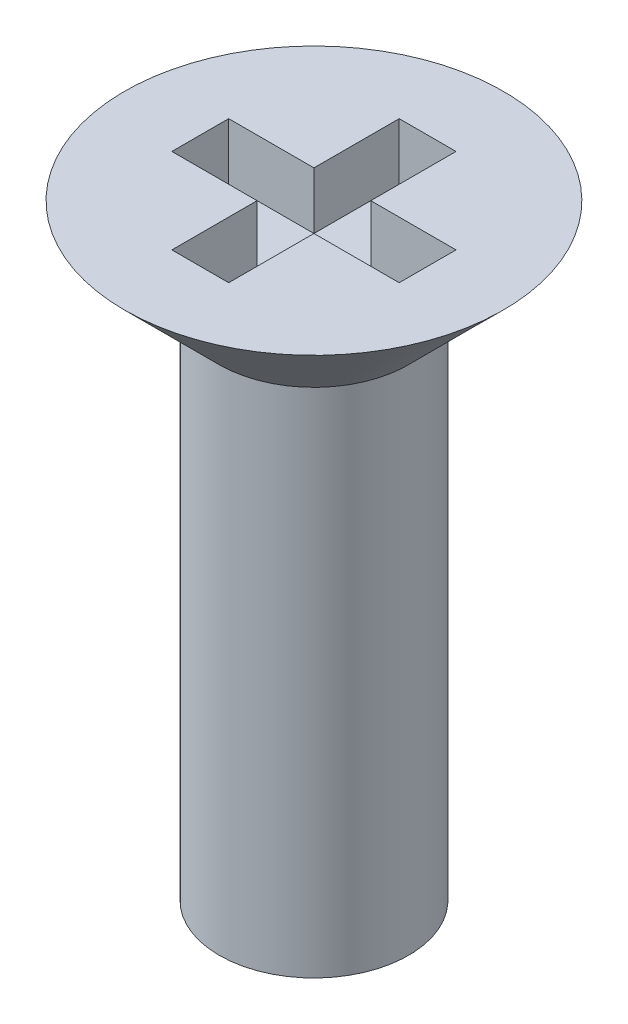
ISO-10303-21;
HEADER;
FILE_DESCRIPTION(('STEP AP214'),'2;1');
FILE_NAME('part.step','',(''),(''),'','','');
FILE_SCHEMA(('AUTOMOTIVE_DESIGN { 1 0 10303 214 1 1 1 1 }'));
ENDSEC;
DATA;
#1=APPLICATION_CONTEXT('core data for automotive mechanical design processes');
#2=APPLICATION_PROTOCOL_DEFINITION('international standard','automotive_design',2000,#1);
#3=PRODUCT_CONTEXT('',#1,'mechanical');
#4=PRODUCT('Part','Part','',(#3));
#5=PRODUCT_RELATED_PRODUCT_CATEGORY('part','',(#4));
#6=PRODUCT_DEFINITION_FORMATION('','',#4);
#7=PRODUCT_DEFINITION_CONTEXT('part definition',#1,'design');
#8=PRODUCT_DEFINITION('design','',#6,#7);
#9=PRODUCT_DEFINITION_SHAPE('','',#8);
#10=(LENGTH_UNIT() NAMED_UNIT(*) SI_UNIT(.MILLI.,.METRE.));
#11=(NAMED_UNIT(*) PLANE_ANGLE_UNIT() SI_UNIT($,.RADIAN.));
#12=(NAMED_UNIT(*) SI_UNIT($,.STERADIAN.) SOLID_ANGLE_UNIT());
#13=UNCERTAINTY_MEASURE_WITH_UNIT(LENGTH_MEASURE(1.E-05),#10,'distance_accuracy_value','');
#14=(GEOMETRIC_REPRESENTATION_CONTEXT(3) GLOBAL_UNCERTAINTY_ASSIGNED_CONTEXT((#13)) GLOBAL_UNIT_ASSIGNED_CONTEXT((#10,
#11,#12)) REPRESENTATION_CONTEXT('',''));
#15=CARTESIAN_POINT('',(0.,0.,0.));
#16=DIRECTION('',(0.,0.,1.));
#17=DIRECTION('',(1.,0.,0.));
#18=AXIS2_PLACEMENT_3D('',#15,#16,#17);
#19=CARTESIAN_POINT('',(2.5,8.,0.));
#20=DIRECTION('',(0.,-1.,0.));
#21=DIRECTION('',(0.,0.,-1.));
#22=AXIS2_PLACEMENT_3D('',#19,#20,#21);
#23=PLANE('',#22);
#24=CARTESIAN_POINT('',(0.,8.00000000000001,0.));
#25=DIRECTION('',(0.,1.,0.));
#26=DIRECTION('',(0.,0.,1.));
#27=AXIS2_PLACEMENT_3D('',#24,#25,#26);
#28=CIRCLE('',#27,2.5);
#29=CARTESIAN_POINT('',(0.,8.00000000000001,2.5));
#30=VERTEX_POINT('',#29);
#31=EDGE_CURVE('E297',#30,#30,#28,.T.);
#32=ORIENTED_EDGE('',*,*,#31,.T.);
#33=EDGE_LOOP('',(#32));
#34=FACE_BOUND('',#33,.T.);
#35=DIRECTION('',(-1.,0.,1.49574703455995E-09));
#36=VECTOR('',#35,1.);
#37=CARTESIAN_POINT('',(5.60905178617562E-10,8.,0.375));
#38=LINE('',#37,#36);
#39=CARTESIAN_POINT('',(-0.375,8.,0.375000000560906));
#40=VERTEX_POINT('',#39);
#41=CARTESIAN_POINT('',(-1.49999999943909,8.,0.375000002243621));
#42=VERTEX_POINT('',#41);
#43=EDGE_CURVE('E238',#40,#42,#38,.T.);
#44=ORIENTED_EDGE('',*,*,#43,.T.);
#45=DIRECTION('',(1.49574714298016E-09,0.,1.));
#46=VECTOR('',#45,1.);
#47=CARTESIAN_POINT('',(-1.50000000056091,8.,-0.37499999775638));
#48=LINE('',#47,#46);
#49=CARTESIAN_POINT('',(-1.50000000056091,8.,-0.37499999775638));
#50=VERTEX_POINT('',#49);
#51=EDGE_CURVE('E254',#50,#42,#48,.T.);
#52=ORIENTED_EDGE('',*,*,#51,.F.);
#53=DIRECTION('',(1.,0.,-1.49574725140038E-09));
#54=VECTOR('',#53,1.);
#55=CARTESIAN_POINT('',(-1.50000000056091,8.,-0.37499999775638));
#56=LINE('',#55,#54);
#57=CARTESIAN_POINT('',(-0.375000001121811,8.,-0.375));
#58=VERTEX_POINT('',#57);
#59=EDGE_CURVE('E258',#50,#58,#56,.T.);
#60=ORIENTED_EDGE('',*,*,#59,.T.);
#61=DIRECTION('',(-2.99149417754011E-09,0.,-1.));
#62=VECTOR('',#61,1.);
#63=CARTESIAN_POINT('',(-0.375,8.,1.12181035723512E-09));
#64=LINE('',#63,#62);
#65=CARTESIAN_POINT('',(-0.375000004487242,8.,-1.49999999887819));
#66=VERTEX_POINT('',#65);
#67=EDGE_CURVE('E207',#58,#66,#64,.T.);
#68=ORIENTED_EDGE('',*,*,#67,.T.);
#69=DIRECTION('',(-1.,0.,2.99149428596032E-09));
#70=VECTOR('',#69,1.);
#71=CARTESIAN_POINT('',(0.374999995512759,8.,-1.50000000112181));
#72=LINE('',#71,#70);
#73=CARTESIAN_POINT('',(0.374999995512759,8.,-1.50000000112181));
#74=VERTEX_POINT('',#73);
#75=EDGE_CURVE('E223',#74,#66,#72,.T.);
#76=ORIENTED_EDGE('',*,*,#75,.F.);
#77=DIRECTION('',(2.99149439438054E-09,0.,1.));
#78=VECTOR('',#77,1.);
#79=CARTESIAN_POINT('',(0.374999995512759,8.,-1.50000000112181));
#80=LINE('',#79,#78);
#81=CARTESIAN_POINT('',(0.375,8.,-0.375000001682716));
#82=VERTEX_POINT('',#81);
#83=EDGE_CURVE('E212',#74,#82,#80,.T.);
#84=ORIENTED_EDGE('',*,*,#83,.T.);
#85=DIRECTION('',(1.,0.,-4.48724087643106E-09));
#86=VECTOR('',#85,1.);
#87=CARTESIAN_POINT('',(-1.68271536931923E-09,8.,-0.375));
#88=LINE('',#87,#86);
#89=CARTESIAN_POINT('',(1.49999999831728,8.,-0.375000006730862));
#90=VERTEX_POINT('',#89);
#91=EDGE_CURVE('E200',#82,#90,#88,.T.);
#92=ORIENTED_EDGE('',*,*,#91,.T.);
#93=DIRECTION('',(-4.48724098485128E-09,0.,-1.));
#94=VECTOR('',#93,1.);
#95=CARTESIAN_POINT('',(1.50000000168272,8.,0.374999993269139));
#96=LINE('',#95,#94);
#97=CARTESIAN_POINT('',(1.50000000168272,8.,0.374999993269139));
#98=VERTEX_POINT('',#97);
#99=EDGE_CURVE('E179',#98,#90,#96,.T.);
#100=ORIENTED_EDGE('',*,*,#99,.F.);
#101=CARTESIAN_POINT('',(0.375,8.,0.374999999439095));
#102=VERTEX_POINT('',#101);
#103=EDGE_CURVE('E251',#98,#102,#38,.T.);
#104=ORIENTED_EDGE('',*,*,#103,.T.);
#105=DIRECTION('',(0.,0.,1.));
#106=VECTOR('',#105,1.);
#107=CARTESIAN_POINT('',(0.375,8.,0.));
#108=LINE('',#107,#106);
#109=CARTESIAN_POINT('',(0.375,8.,1.5));
#110=VERTEX_POINT('',#109);
#111=EDGE_CURVE('E81',#102,#110,#108,.T.);
#112=ORIENTED_EDGE('',*,*,#111,.T.);
#113=DIRECTION('',(1.,0.,0.));
#114=VECTOR('',#113,1.);
#115=CARTESIAN_POINT('',(-0.375,8.,1.5));
#116=LINE('',#115,#114);
#117=CARTESIAN_POINT('',(-0.375,8.,1.5));
#118=VERTEX_POINT('',#117);
#119=EDGE_CURVE('E285',#118,#110,#116,.T.);
#120=ORIENTED_EDGE('',*,*,#119,.F.);
#121=DIRECTION('',(0.,0.,-1.));
#122=VECTOR('',#121,1.);
#123=CARTESIAN_POINT('',(-0.375,8.,1.5));
#124=LINE('',#123,#122);
#125=EDGE_CURVE('E276',#118,#40,#124,.T.);
#126=ORIENTED_EDGE('',*,*,#125,.T.);
#127=EDGE_LOOP('',(#44,#52,#60,#68,#76,#84,#92,#100,#104,#112,#120,#126));
#128=FACE_BOUND('',#127,.T.);
#129=ADVANCED_FACE('F46',(#34,#128),#23,.F.);
#130=CARTESIAN_POINT('',(0.375,7.25,0.));
#131=DIRECTION('',(-1.,0.,0.));
#132=DIRECTION('',(0.,0.,1.));
#133=AXIS2_PLACEMENT_3D('',#130,#131,#132);
#134=PLANE('',#133);
#135=ORIENTED_EDGE('',*,*,#111,.F.);
#136=DIRECTION('',(0.,-1.,0.));
#137=VECTOR('',#136,1.);
#138=CARTESIAN_POINT('',(0.375,7.25,0.374999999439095));
#139=LINE('',#138,#137);
#140=CARTESIAN_POINT('',(0.375,7.25,0.374999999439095));
#141=VERTEX_POINT('',#140);
#142=EDGE_CURVE('E269',#102,#141,#139,.T.);
#143=ORIENTED_EDGE('',*,*,#142,.T.);
#144=DIRECTION('',(0.,0.,1.));
#145=VECTOR('',#144,1.);
#146=CARTESIAN_POINT('',(0.375,7.25,0.));
#147=LINE('',#146,#145);
#148=CARTESIAN_POINT('',(0.375,7.25,1.5));
#149=VERTEX_POINT('',#148);
#150=EDGE_CURVE('E273',#141,#149,#147,.T.);
#151=ORIENTED_EDGE('',*,*,#150,.T.);
#152=DIRECTION('',(0.,1.,0.));
#153=VECTOR('',#152,1.);
#154=CARTESIAN_POINT('',(0.375,7.25,1.5));
#155=LINE('',#154,#153);
#156=EDGE_CURVE('E294',#149,#110,#155,.T.);
#157=ORIENTED_EDGE('',*,*,#156,.T.);
#158=EDGE_LOOP('',(#135,#143,#151,#157));
#159=FACE_BOUND('',#158,.T.);
#160=ADVANCED_FACE('F316',(#159),#134,.T.);
#161=CARTESIAN_POINT('',(-0.375,7.25,1.5));
#162=DIRECTION('',(1.,0.,0.));
#163=DIRECTION('',(0.,0.,-1.));
#164=AXIS2_PLACEMENT_3D('',#161,#162,#163);
#165=PLANE('',#164);
#166=DIRECTION('',(0.,0.,-1.));
#167=VECTOR('',#166,1.);
#168=CARTESIAN_POINT('',(-0.375,7.25,1.5));
#169=LINE('',#168,#167);
#170=CARTESIAN_POINT('',(-0.375,7.25,1.5));
#171=VERTEX_POINT('',#170);
#172=CARTESIAN_POINT('',(-0.375,7.25,0.375000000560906));
#173=VERTEX_POINT('',#172);
#174=EDGE_CURVE('E280',#171,#173,#169,.T.);
#175=ORIENTED_EDGE('',*,*,#174,.T.);
#176=DIRECTION('',(0.,1.,0.));
#177=VECTOR('',#176,1.);
#178=CARTESIAN_POINT('',(-0.375,7.25,0.375000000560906));
#179=LINE('',#178,#177);
#180=EDGE_CURVE('E92',#173,#40,#179,.T.);
#181=ORIENTED_EDGE('',*,*,#180,.T.);
#182=ORIENTED_EDGE('',*,*,#125,.F.);
#183=DIRECTION('',(0.,1.,0.));
#184=VECTOR('',#183,1.);
#185=CARTESIAN_POINT('',(-0.375,7.25,1.5));
#186=LINE('',#185,#184);
#187=EDGE_CURVE('E67',#171,#118,#186,.T.);
#188=ORIENTED_EDGE('',*,*,#187,.F.);
#189=EDGE_LOOP('',(#175,#181,#182,#188));
#190=FACE_BOUND('',#189,.T.);
#191=ADVANCED_FACE('F312',(#190),#165,.T.);
#192=CARTESIAN_POINT('',(0.,0.,0.));
#193=DIRECTION('',(0.,1.,0.));
#194=DIRECTION('',(0.,0.,1.));
#195=AXIS2_PLACEMENT_3D('',#192,#193,#194);
#196=PLANE('',#195);
#197=CARTESIAN_POINT('',(0.,0.,0.));
#198=DIRECTION('',(0.,1.,0.));
#199=DIRECTION('',(0.,0.,1.));
#200=AXIS2_PLACEMENT_3D('',#197,#198,#199);
#201=CIRCLE('',#200,1.25000000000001);
#202=CARTESIAN_POINT('',(0.,0.,1.25000000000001));
#203=VERTEX_POINT('',#202);
#204=EDGE_CURVE('E11',#203,#203,#201,.T.);
#205=ORIENTED_EDGE('',*,*,#204,.F.);
#206=EDGE_LOOP('',(#205));
#207=FACE_BOUND('',#206,.T.);
#208=ADVANCED_FACE('F48',(#207),#196,.F.);
#209=CARTESIAN_POINT('',(0.,90.8693037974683,0.));
#210=DIRECTION('',(0.,1.,0.));
#211=DIRECTION('',(0.,0.,1.));
#212=AXIS2_PLACEMENT_3D('',#209,#210,#211);
#213=CYLINDRICAL_SURFACE('',#212,1.25000000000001);
#214=CARTESIAN_POINT('',(0.,6.75000000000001,0.));
#215=DIRECTION('',(0.,1.,0.));
#216=DIRECTION('',(0.,0.,1.));
#217=AXIS2_PLACEMENT_3D('',#214,#215,#216);
#218=CIRCLE('',#217,1.25000000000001);
#219=CARTESIAN_POINT('',(0.,6.75000000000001,1.25000000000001));
#220=VERTEX_POINT('',#219);
#221=EDGE_CURVE('E56',#220,#220,#218,.T.);
#222=ORIENTED_EDGE('',*,*,#221,.F.);
#223=EDGE_LOOP('',(#222));
#224=FACE_BOUND('',#223,.T.);
#225=ORIENTED_EDGE('',*,*,#204,.T.);
#226=EDGE_LOOP('',(#225));
#227=FACE_BOUND('',#226,.T.);
#228=ADVANCED_FACE('F306',(#224,#227),#213,.T.);
#229=CARTESIAN_POINT('',(0.,6.75000000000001,0.));
#230=DIRECTION('',(0.,1.,0.));
#231=DIRECTION('',(0.,0.,1.));
#232=AXIS2_PLACEMENT_3D('',#229,#230,#231);
#233=CONICAL_SURFACE('',#232,1.25000000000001,0.785398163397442);
#234=ORIENTED_EDGE('',*,*,#31,.F.);
#235=EDGE_LOOP('',(#234));
#236=FACE_BOUND('',#235,.T.);
#237=ORIENTED_EDGE('',*,*,#221,.T.);
#238=EDGE_LOOP('',(#237));
#239=FACE_BOUND('',#238,.T.);
#240=ADVANCED_FACE('F304',(#236,#239),#233,.T.);
#241=CARTESIAN_POINT('',(-0.375,7.25,1.5));
#242=DIRECTION('',(0.,0.,1.));
#243=DIRECTION('',(1.,0.,0.));
#244=AXIS2_PLACEMENT_3D('',#241,#242,#243);
#245=PLANE('',#244);
#246=ORIENTED_EDGE('',*,*,#119,.T.);
#247=ORIENTED_EDGE('',*,*,#156,.F.);
#248=DIRECTION('',(1.,0.,0.));
#249=VECTOR('',#248,1.);
#250=CARTESIAN_POINT('',(-0.375,7.25,1.5));
#251=LINE('',#250,#249);
#252=EDGE_CURVE('E275',#171,#149,#251,.T.);
#253=ORIENTED_EDGE('',*,*,#252,.F.);
#254=ORIENTED_EDGE('',*,*,#187,.T.);
#255=EDGE_LOOP('',(#246,#247,#253,#254));
#256=FACE_BOUND('',#255,.T.);
#257=ADVANCED_FACE('F329',(#256),#245,.F.);
#258=CARTESIAN_POINT('',(0.375,7.25,1.5));
#259=DIRECTION('',(0.,1.,0.));
#260=DIRECTION('',(0.,0.,1.));
#261=AXIS2_PLACEMENT_3D('',#258,#259,#260);
#262=PLANE('',#261);
#263=ORIENTED_EDGE('',*,*,#150,.F.);
#264=DIRECTION('',(-1.,0.,1.49574703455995E-09));
#265=VECTOR('',#264,1.);
#266=CARTESIAN_POINT('',(5.60905178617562E-10,7.25,0.375));
#267=LINE('',#266,#265);
#268=CARTESIAN_POINT('',(1.50000000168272,7.25,0.374999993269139));
#269=VERTEX_POINT('',#268);
#270=EDGE_CURVE('E192',#269,#141,#267,.T.);
#271=ORIENTED_EDGE('',*,*,#270,.F.);
#272=DIRECTION('',(-4.48724098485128E-09,0.,-1.));
#273=VECTOR('',#272,1.);
#274=CARTESIAN_POINT('',(1.50000000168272,7.25,0.374999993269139));
#275=LINE('',#274,#273);
#276=CARTESIAN_POINT('',(1.49999999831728,7.25,-0.375000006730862));
#277=VERTEX_POINT('',#276);
#278=EDGE_CURVE('E178',#269,#277,#275,.T.);
#279=ORIENTED_EDGE('',*,*,#278,.T.);
#280=DIRECTION('',(1.,0.,-4.48724087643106E-09));
#281=VECTOR('',#280,1.);
#282=CARTESIAN_POINT('',(-1.68271536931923E-09,7.25,-0.375));
#283=LINE('',#282,#281);
#284=CARTESIAN_POINT('',(0.375,7.25,-0.375000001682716));
#285=VERTEX_POINT('',#284);
#286=EDGE_CURVE('E166',#285,#277,#283,.T.);
#287=ORIENTED_EDGE('',*,*,#286,.F.);
#288=DIRECTION('',(2.99149439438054E-09,0.,1.));
#289=VECTOR('',#288,1.);
#290=CARTESIAN_POINT('',(0.374999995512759,7.25,-1.50000000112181));
#291=LINE('',#290,#289);
#292=CARTESIAN_POINT('',(0.374999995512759,7.25,-1.50000000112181));
#293=VERTEX_POINT('',#292);
#294=EDGE_CURVE('E216',#293,#285,#291,.T.);
#295=ORIENTED_EDGE('',*,*,#294,.F.);
#296=DIRECTION('',(-1.,0.,2.99149428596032E-09));
#297=VECTOR('',#296,1.);
#298=CARTESIAN_POINT('',(0.374999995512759,7.25,-1.50000000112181));
#299=LINE('',#298,#297);
#300=CARTESIAN_POINT('',(-0.375000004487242,7.25,-1.49999999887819));
#301=VERTEX_POINT('',#300);
#302=EDGE_CURVE('E211',#293,#301,#299,.T.);
#303=ORIENTED_EDGE('',*,*,#302,.T.);
#304=DIRECTION('',(-2.99149417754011E-09,0.,-1.));
#305=VECTOR('',#304,1.);
#306=CARTESIAN_POINT('',(-0.375,7.25,1.12181035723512E-09));
#307=LINE('',#306,#305);
#308=CARTESIAN_POINT('',(-0.375000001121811,7.25,-0.375));
#309=VERTEX_POINT('',#308);
#310=EDGE_CURVE('E208',#309,#301,#307,.T.);
#311=ORIENTED_EDGE('',*,*,#310,.F.);
#312=DIRECTION('',(1.,0.,-1.49574725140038E-09));
#313=VECTOR('',#312,1.);
#314=CARTESIAN_POINT('',(-1.50000000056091,7.25,-0.37499999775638));
#315=LINE('',#314,#313);
#316=CARTESIAN_POINT('',(-1.50000000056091,7.25,-0.37499999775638));
#317=VERTEX_POINT('',#316);
#318=EDGE_CURVE('E246',#317,#309,#315,.T.);
#319=ORIENTED_EDGE('',*,*,#318,.F.);
#320=DIRECTION('',(1.49574714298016E-09,0.,1.));
#321=VECTOR('',#320,1.);
#322=CARTESIAN_POINT('',(-1.50000000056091,7.25,-0.37499999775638));
#323=LINE('',#322,#321);
#324=CARTESIAN_POINT('',(-1.49999999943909,7.25,0.375000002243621));
#325=VERTEX_POINT('',#324);
#326=EDGE_CURVE('E241',#317,#325,#323,.T.);
#327=ORIENTED_EDGE('',*,*,#326,.T.);
#328=EDGE_CURVE('E242',#173,#325,#267,.T.);
#329=ORIENTED_EDGE('',*,*,#328,.F.);
#330=ORIENTED_EDGE('',*,*,#174,.F.);
#331=ORIENTED_EDGE('',*,*,#252,.T.);
#332=EDGE_LOOP('',(#263,#271,#279,#287,#295,#303,#311,#319,#327,#329,#330,#331));
#333=FACE_BOUND('',#332,.T.);
#334=ADVANCED_FACE('F191',(#333),#262,.T.);
#335=CARTESIAN_POINT('',(5.60905178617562E-10,7.25,0.375));
#336=DIRECTION('',(-1.49574703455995E-09,0.,-1.));
#337=DIRECTION('',(-1.,0.,1.49574703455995E-09));
#338=AXIS2_PLACEMENT_3D('',#335,#336,#337);
#339=PLANE('',#338);
#340=ORIENTED_EDGE('',*,*,#103,.F.);
#341=DIRECTION('',(0.,1.,0.));
#342=VECTOR('',#341,1.);
#343=CARTESIAN_POINT('',(1.50000000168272,7.25,0.374999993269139));
#344=LINE('',#343,#342);
#345=EDGE_CURVE('E188',#269,#98,#344,.T.);
#346=ORIENTED_EDGE('',*,*,#345,.F.);
#347=ORIENTED_EDGE('',*,*,#270,.T.);
#348=ORIENTED_EDGE('',*,*,#142,.F.);
#349=EDGE_LOOP('',(#340,#346,#347,#348));
#350=FACE_BOUND('',#349,.T.);
#351=ADVANCED_FACE('F339',(#350),#339,.T.);
#352=CARTESIAN_POINT('',(-1.50000000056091,7.25,-0.37499999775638));
#353=DIRECTION('',(1.49574725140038E-09,0.,1.));
#354=DIRECTION('',(1.,0.,-1.49574725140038E-09));
#355=AXIS2_PLACEMENT_3D('',#352,#353,#354);
#356=PLANE('',#355);
#357=DIRECTION('',(0.,1.,0.));
#358=VECTOR('',#357,1.);
#359=CARTESIAN_POINT('',(-0.375000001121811,7.25,-0.374999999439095));
#360=LINE('',#359,#358);
#361=EDGE_CURVE('E235',#309,#58,#360,.T.);
#362=ORIENTED_EDGE('',*,*,#361,.T.);
#363=ORIENTED_EDGE('',*,*,#59,.F.);
#364=DIRECTION('',(0.,1.,0.));
#365=VECTOR('',#364,1.);
#366=CARTESIAN_POINT('',(-1.50000000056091,7.25,-0.37499999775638));
#367=LINE('',#366,#365);
#368=EDGE_CURVE('E250',#317,#50,#367,.T.);
#369=ORIENTED_EDGE('',*,*,#368,.F.);
#370=ORIENTED_EDGE('',*,*,#318,.T.);
#371=EDGE_LOOP('',(#362,#363,#369,#370));
#372=FACE_BOUND('',#371,.T.);
#373=ADVANCED_FACE('F346',(#372),#356,.T.);
#374=ORIENTED_EDGE('',*,*,#328,.T.);
#375=DIRECTION('',(0.,1.,0.));
#376=VECTOR('',#375,1.);
#377=CARTESIAN_POINT('',(-1.49999999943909,7.25,0.375000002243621));
#378=LINE('',#377,#376);
#379=EDGE_CURVE('E264',#325,#42,#378,.T.);
#380=ORIENTED_EDGE('',*,*,#379,.T.);
#381=ORIENTED_EDGE('',*,*,#43,.F.);
#382=ORIENTED_EDGE('',*,*,#180,.F.);
#383=EDGE_LOOP('',(#374,#380,#381,#382));
#384=FACE_BOUND('',#383,.T.);
#385=ADVANCED_FACE('F342',(#384),#339,.T.);
#386=CARTESIAN_POINT('',(-1.50000000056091,7.25,-0.37499999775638));
#387=DIRECTION('',(-1.,0.,1.49574714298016E-09));
#388=DIRECTION('',(1.49574714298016E-09,0.,1.));
#389=AXIS2_PLACEMENT_3D('',#386,#387,#388);
#390=PLANE('',#389);
#391=ORIENTED_EDGE('',*,*,#51,.T.);
#392=ORIENTED_EDGE('',*,*,#379,.F.);
#393=ORIENTED_EDGE('',*,*,#326,.F.);
#394=ORIENTED_EDGE('',*,*,#368,.T.);
#395=EDGE_LOOP('',(#391,#392,#393,#394));
#396=FACE_BOUND('',#395,.T.);
#397=ADVANCED_FACE('F345',(#396),#390,.F.);
#398=CARTESIAN_POINT('',(-0.375,7.25,1.12181035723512E-09));
#399=DIRECTION('',(1.,0.,-2.99149417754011E-09));
#400=DIRECTION('',(-2.99149417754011E-09,0.,-1.));
#401=AXIS2_PLACEMENT_3D('',#398,#399,#400);
#402=PLANE('',#401);
#403=ORIENTED_EDGE('',*,*,#310,.T.);
#404=DIRECTION('',(0.,1.,0.));
#405=VECTOR('',#404,1.);
#406=CARTESIAN_POINT('',(-0.375000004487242,7.25,-1.49999999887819));
#407=LINE('',#406,#405);
#408=EDGE_CURVE('E232',#301,#66,#407,.T.);
#409=ORIENTED_EDGE('',*,*,#408,.T.);
#410=ORIENTED_EDGE('',*,*,#67,.F.);
#411=ORIENTED_EDGE('',*,*,#361,.F.);
#412=EDGE_LOOP('',(#403,#409,#410,#411));
#413=FACE_BOUND('',#412,.T.);
#414=ADVANCED_FACE('F349',(#413),#402,.T.);
#415=CARTESIAN_POINT('',(0.374999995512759,7.25,-1.50000000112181));
#416=DIRECTION('',(-1.,0.,2.99149439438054E-09));
#417=DIRECTION('',(2.99149439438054E-09,0.,1.));
#418=AXIS2_PLACEMENT_3D('',#415,#416,#417);
#419=PLANE('',#418);
#420=DIRECTION('',(0.,1.,0.));
#421=VECTOR('',#420,1.);
#422=CARTESIAN_POINT('',(0.37499999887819,7.25,-0.375000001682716));
#423=LINE('',#422,#421);
#424=EDGE_CURVE('E172',#285,#82,#423,.T.);
#425=ORIENTED_EDGE('',*,*,#424,.T.);
#426=ORIENTED_EDGE('',*,*,#83,.F.);
#427=DIRECTION('',(0.,1.,0.));
#428=VECTOR('',#427,1.);
#429=CARTESIAN_POINT('',(0.374999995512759,7.25,-1.50000000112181));
#430=LINE('',#429,#428);
#431=EDGE_CURVE('E219',#293,#74,#430,.T.);
#432=ORIENTED_EDGE('',*,*,#431,.F.);
#433=ORIENTED_EDGE('',*,*,#294,.T.);
#434=EDGE_LOOP('',(#425,#426,#432,#433));
#435=FACE_BOUND('',#434,.T.);
#436=ADVANCED_FACE('F356',(#435),#419,.T.);
#437=CARTESIAN_POINT('',(0.374999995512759,7.25,-1.50000000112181));
#438=DIRECTION('',(-2.99149428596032E-09,0.,-1.));
#439=DIRECTION('',(-1.,0.,2.99149428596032E-09));
#440=AXIS2_PLACEMENT_3D('',#437,#438,#439);
#441=PLANE('',#440);
#442=ORIENTED_EDGE('',*,*,#75,.T.);
#443=ORIENTED_EDGE('',*,*,#408,.F.);
#444=ORIENTED_EDGE('',*,*,#302,.F.);
#445=ORIENTED_EDGE('',*,*,#431,.T.);
#446=EDGE_LOOP('',(#442,#443,#444,#445));
#447=FACE_BOUND('',#446,.T.);
#448=ADVANCED_FACE('F358',(#447),#441,.F.);
#449=CARTESIAN_POINT('',(-1.68271536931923E-09,7.25,-0.375));
#450=DIRECTION('',(4.48724087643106E-09,0.,1.));
#451=DIRECTION('',(1.,0.,-4.48724087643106E-09));
#452=AXIS2_PLACEMENT_3D('',#449,#450,#451);
#453=PLANE('',#452);
#454=ORIENTED_EDGE('',*,*,#286,.T.);
#455=DIRECTION('',(0.,1.,0.));
#456=VECTOR('',#455,1.);
#457=CARTESIAN_POINT('',(1.49999999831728,7.25,-0.375000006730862));
#458=LINE('',#457,#456);
#459=EDGE_CURVE('E170',#277,#90,#458,.T.);
#460=ORIENTED_EDGE('',*,*,#459,.T.);
#461=ORIENTED_EDGE('',*,*,#91,.F.);
#462=ORIENTED_EDGE('',*,*,#424,.F.);
#463=EDGE_LOOP('',(#454,#460,#461,#462));
#464=FACE_BOUND('',#463,.T.);
#465=ADVANCED_FACE('F168',(#464),#453,.T.);
#466=CARTESIAN_POINT('',(1.50000000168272,7.25,0.374999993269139));
#467=DIRECTION('',(1.,0.,-4.48724098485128E-09));
#468=DIRECTION('',(-4.48724098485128E-09,0.,-1.));
#469=AXIS2_PLACEMENT_3D('',#466,#467,#468);
#470=PLANE('',#469);
#471=ORIENTED_EDGE('',*,*,#99,.T.);
#472=ORIENTED_EDGE('',*,*,#459,.F.);
#473=ORIENTED_EDGE('',*,*,#278,.F.);
#474=ORIENTED_EDGE('',*,*,#345,.T.);
#475=EDGE_LOOP('',(#471,#472,#473,#474));
#476=FACE_BOUND('',#475,.T.);
#477=ADVANCED_FACE('F183',(#476),#470,.F.);
#478=CLOSED_SHELL('',(#129,#160,#191,#208,#228,#240,#257,#334,#351,#373,#385,#397,#414,#436,
#448,#465,#477));
#479=MANIFOLD_SOLID_BREP('B2',#478);
#480=ADVANCED_BREP_SHAPE_REPRESENTATION('',(#18,#479),#14);
#481=SHAPE_DEFINITION_REPRESENTATION(#9,#480);
ENDSEC;
END-ISO-10303-21;
